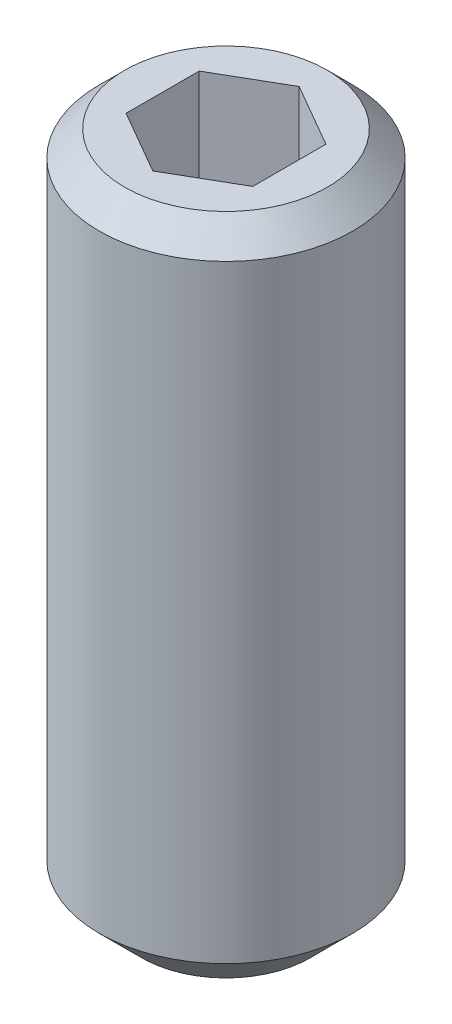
from build123d import *

# Parameters (mm, degrees)
ENL_V_MAT_EXTRU_1_DEPTH = 1.5


with BuildPart() as part:
    # Esquisse1 → Base-R_volution (revolve)
    with BuildSketch(Plane.XY, mode=Mode.PRIVATE) as base_r_volution_sk:
        Polygon((0.75, 0), (1.2, 0), (1.5, -0.3), (1.5, -7.5), (1, -8), (0, -8), (0, -1.933012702), (0.75, -1.5), align=None)
    revolve(base_r_volution_sk.sketch.rotate(Axis((0, -8, 0), (0, 1, 0)), 90), axis=Axis((0, -8, 0), (0, 1, 0)))

    # Esquisse2 → Enl_v. mat.-Extru.1 (cut)
    with BuildSketch(Plane(origin=(0, 0, 0), x_dir=(-1, 0, 0), z_dir=(0, 1, 0))):
        Polygon((0.75, -0.433012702), (0.75, 0.433012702), (0, 0.866025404), (-0.75, 0.433012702), (-0.75, -0.433012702), (0, -0.866025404), align=None)
    extrude(amount=-ENL_V_MAT_EXTRU_1_DEPTH, mode=Mode.SUBTRACT)


solid = part.part
